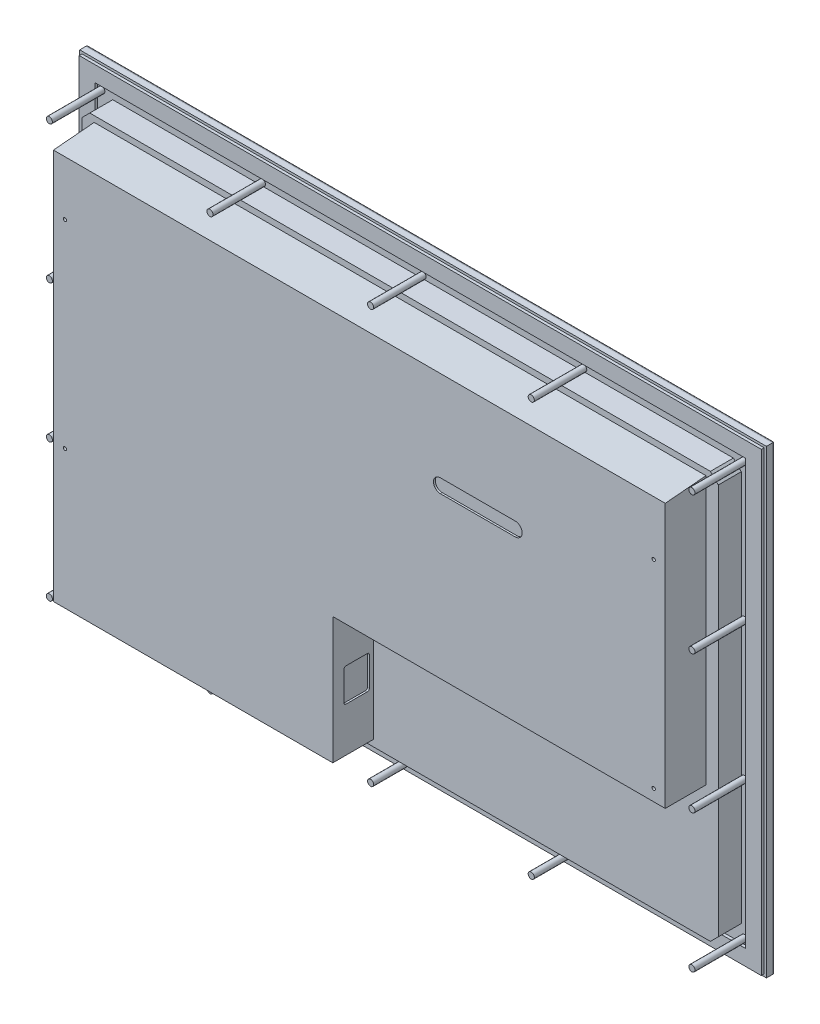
from build123d import *

# Parameters (mm, degrees)
SKETCH1_W                                 = 558.8
SKETCH1_H                                 = 374.65
BEZEL_DEPTH                               = 7.112
BEZEL_RADIUS_R                            = 2
SKETCH2_W                                 = 474.472
SKETCH2_H                                 = 296.672
WINDOW_DEPTH                              = 2.35
SKETCH3_W                                 = 554.99
SKETCH3_H                                 = 370.84
SKETCH3_W_2                               = 529.59
SKETCH3_H_2                               = 345.44
GASKET_DEPTH                              = 2.3
SKETCH5_R                                 = 2.5
PANEL_FRAME_STUDS_DEPTH                   = 42.7
BODY_DEPTH                                = 18.7198
REAR_COVER_DEPTH                          = 33.147
REAR_COVER_SLOPE_ANGLE                    = 5
SKETCH10_R                                = 1.5875
VIDEO_TOUCH_INTERFACE_DEPTH               = 1.524
POWER_AC_ONLY_DEPTH                       = 1.524
CONTROLS_BUTTONS_DEPTH                    = 1.524
F_6_32_ACCESSORY_BRACKET_HOLES_AT_2_COUNT = 2
F_6_32_ACCESSORY_BRACKET_HOLES_AT_2_PITCH = 161.3408
F_6_32_ACCESSORY_BRACKET_HOLES_AT_3_COUNT = 2
F_6_32_ACCESSORY_BRACKET_HOLES_AT_3_PITCH = 505.483934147
F_6_32_ACCESSORY_BRACKET_HOLES_AT_4_COUNT = 2
F_6_32_ACCESSORY_BRACKET_HOLES_AT_4_PITCH = 479.044


with BuildPart() as part:
    # Sketch1 → Bezel (new body)
    with BuildSketch(Plane.XY):
        Rectangle(SKETCH1_W, SKETCH1_H)
    extrude(amount=-BEZEL_DEPTH)

    # Bezel Radius
    bezel_radius_edges = [part.edges().sort_by_distance(p)[0] for p in [
        (279.4, 0, -7.112),
        (0, 187.325, -7.112),
        (-279.4, 0, -7.112),
        (0, -187.325, -7.112),
    ]]
    fillet(bezel_radius_edges, radius=BEZEL_RADIUS_R)

    # Sketch2 → Window (cut)
    with BuildSketch(Plane(origin=(0, 0, -7.112), x_dir=(-1, 0, 0), z_dir=(0, 0, -1))):
        Rectangle(SKETCH2_W, SKETCH2_H)
    extrude(amount=-WINDOW_DEPTH, mode=Mode.SUBTRACT)

    # Sketch3 → Gasket (add)
    with BuildSketch(Plane.XY):
        Rectangle(SKETCH3_W, SKETCH3_H)
        Rectangle(SKETCH3_W_2, SKETCH3_H_2, mode=Mode.SUBTRACT)
    extrude(amount=GASKET_DEPTH)

    # Sketch5 → Panel Frame Studs (add)
    with BuildSketch(Plane.XY):
        with Locations(Location((-261.4168, 168.1226, 0), (0, 0, 180))):
            Circle(SKETCH5_R)
        with Locations(Location((-130.7084, 168.1226, 0), (0, 0, 180))):
            Circle(SKETCH5_R)
        with Locations(Location((-130.7084, -168.1226, 0), (0, 0, 180))):
            Circle(SKETCH5_R)
        with Locations(Location((0, 168.1226, 0), (0, 0, 180))):
            Circle(SKETCH5_R)
        with Locations(Location((0, -168.1226, 0), (0, 0, 180))):
            Circle(SKETCH5_R)
        with Locations(Location((130.7084, 168.1226, 0), (0, 0, 180))):
            Circle(SKETCH5_R)
        with Locations(Location((130.7084, -168.1226, 0), (0, 0, 180))):
            Circle(SKETCH5_R)
        with Locations(Location((261.4168, 168.1226, 0), (0, 0, 180))):
            Circle(SKETCH5_R)
        with Locations(Location((261.4168, -168.1226, 0), (0, 0, 180))):
            Circle(SKETCH5_R)
        with Locations(Location((-261.4168, -168.148, 0), (0, 0, 180))):
            Circle(SKETCH5_R)
        with Locations(Location((-261.4168, 56.0324, 0), (0, 0, 180))):
            Circle(SKETCH5_R)
        with Locations(Location((261.4168, 56.0324, 0), (0, 0, 180))):
            Circle(SKETCH5_R)
        with Locations(Location((-261.4168, -56.0578, 0), (0, 0, 180))):
            Circle(SKETCH5_R)
        with Locations(Location((261.4168, -56.0578, 0), (0, 0, 180))):
            Circle(SKETCH5_R)
    extrude(amount=PANEL_FRAME_STUDS_DEPTH)


with BuildPart() as body_2:
    # Sketch6 → Body (new body)
    with BuildSketch(Plane.XY):
        Polygon((-258.9168, 159.21069713), (-252.50489713, 165.6226), (252.50489713, 165.6226), (258.9168, 159.21069713), (258.9168, -159.21069713), (252.50489713, -165.6226), (-252.50489713, -165.6226), (-258.9168, -159.21069713), align=None)
    extrude(amount=BODY_DEPTH)


with BuildPart() as body_3:
    # Sketch7 → Rear Cover (new body)
    with BuildSketch(Plane.XY.offset(18.7198)):
        Polygon((-248.92, 160.782), (248.92, 160.782), (248.92, -57.15), (-21.59, -57.15), (-21.59, -160.274), (-248.92, -160.274), align=None)
    extrude(amount=REAR_COVER_DEPTH)

    # Rear Cover Slope
    rear_cover_slope_faces = [body_3.faces().sort_by_distance(p)[0] for p in [
        (0, 160.782, 35.2933),
    ]]
    draft(rear_cover_slope_faces, Plane.XY.offset(18.7198), REAR_COVER_SLOPE_ANGLE)

    # Sketch10 → Video _ Touch Interface (cut)
    with BuildSketch(Plane(origin=(0, -57.15, 0), x_dir=(1, 0, 0), z_dir=(0, 1, 0))):
        with Locations((127.347305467, -30.10591993)):
            Circle(SKETCH10_R)
        with Locations((94.835305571, -30.10591993)):
            Circle(SKETCH10_R)
        with Locations((161.998305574, -31.62991993)):
            Circle(SKETCH10_R)
        with Locations((136.998311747, -31.62991993)):
            Circle(SKETCH10_R)
        with Locations((177.095734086, -31.62991993)):
            Circle(SKETCH10_R)
        with Locations((202.095727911, -31.62991993)):
            Circle(SKETCH10_R)
        with BuildLine():
            Line((124.75330861, -32.64591993), (124.75330861, -27.56591993))
            ThreePointArc((124.75330861, -27.56591993), (123.86783367, -25.366215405), (121.705308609, -24.393460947))
            Line((121.705308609, -24.393460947), (100.477302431, -24.393460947))
            ThreePointArc((100.477302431, -24.393460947), (98.31477737, -25.366215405), (97.42930243, -27.56591993))
            Line((97.42930243, -27.56591993), (97.42930243, -32.64591993))
            ThreePointArc((97.42930243, -32.64591993), (98.31477737, -34.845624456), (100.477302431, -35.818378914))
            Line((100.477302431, -35.818378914), (121.705308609, -35.818378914))
            ThreePointArc((121.705308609, -35.818378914), (123.86783367, -34.845624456), (124.75330861, -32.64591993))
        make_face()
        with BuildLine():
            Line((159.658269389, -29.07721993), (159.658269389, -34.15721993))
            ThreePointArc((159.658269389, -34.15721993), (158.772794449, -36.356924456), (156.61026939, -37.329678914))
            Line((156.61026939, -37.329678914), (142.386269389, -37.329678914))
            ThreePointArc((142.386269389, -37.329678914), (140.223744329, -36.356924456), (139.338269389, -34.15721993))
            Line((139.338269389, -34.15721993), (139.338269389, -29.07721993))
            ThreePointArc((139.338269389, -29.07721993), (140.22374433, -26.877515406), (142.386269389, -25.904760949))
            Line((142.386269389, -25.904760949), (156.482697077, -25.902219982))
            ThreePointArc((156.482697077, -25.902219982), (158.728131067, -26.831953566), (159.658269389, -29.07721993))
        make_face()
        with BuildLine():
            Line((179.435691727, -29.102619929), (179.435691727, -34.18261993))
            ThreePointArc((179.435691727, -34.18261993), (180.321166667, -36.382324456), (182.483691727, -37.355078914))
            Line((182.483691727, -37.355078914), (196.580119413, -37.35761988))
            ThreePointArc((196.580119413, -37.35761988), (198.825553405, -36.427886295), (199.755691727, -34.18261993))
            Line((199.755691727, -34.18261993), (199.755691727, -29.10261993))
            ThreePointArc((199.755691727, -29.10261993), (198.870216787, -26.902915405), (196.707691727, -25.930160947))
            Line((196.707691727, -25.930160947), (182.483691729, -25.930160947))
            ThreePointArc((182.483691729, -25.930160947), (180.321166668, -26.902915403), (179.435691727, -29.102619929))
        make_face()
        with BuildLine():
            Line((233.203103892, -25.53391993), (217.201103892, -25.53391993))
            Line((217.201103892, -25.53391993), (217.201103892, -30.04241993))
            Line((217.201103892, -30.04241993), (212.756103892, -30.04241993))
            ThreePointArc((212.756103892, -30.04241993), (211.168603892, -31.62991993), (212.756103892, -33.21741993))
            Line((212.756103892, -33.21741993), (217.201103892, -33.21741993))
            Line((217.201103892, -33.21741993), (217.201103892, -37.72591993))
            Line((217.201103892, -37.72591993), (233.203103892, -37.72591993))
            Line((233.203103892, -37.72591993), (233.203103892, -33.21741993))
            Line((233.203103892, -33.21741993), (237.648103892, -33.21741993))
            ThreePointArc((237.648103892, -33.21741993), (239.235603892, -31.62991993), (237.648103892, -30.04241993))
            Line((237.648103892, -30.04241993), (233.203103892, -30.04241993))
            Line((233.203103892, -30.04241993), (233.203103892, -25.53391993))
        make_face()
    extrude(amount=VIDEO_TOUCH_INTERFACE_DEPTH, mode=Mode.SUBTRACT)

    # Sketch11 → Power AC Only (cut)
    with BuildSketch(Plane.ZY.offset(21.59)):
        with BuildLine():
            Line((22.187143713, -98.77325365), (22.187143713, -122.71275204))
            ThreePointArc((22.187143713, -122.71275204), (22.632959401, -123.789828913), (23.709577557, -124.236751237))
            Line((23.709577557, -124.236751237), (41.160952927, -124.236751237))
            ThreePointArc((41.160952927, -124.236751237), (42.238583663, -123.79038197), (42.684952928, -122.712751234))
            Line((42.684952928, -122.712751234), (42.684952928, -98.773252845))
            ThreePointArc((42.684952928, -98.773252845), (42.23913724, -97.696175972), (41.162519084, -97.24925365))
            Line((41.162519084, -97.24925365), (23.711143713, -97.24925365))
            ThreePointArc((23.711143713, -97.24925365), (22.633512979, -97.695622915), (22.187143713, -98.77325365))
        make_face()
    extrude(amount=POWER_AC_ONLY_DEPTH, mode=Mode.SUBTRACT)

    # Sketch12 → Controls Buttons (cut)
    with BuildSketch(Plane.XY.offset(51.8668)):
        with BuildLine():
            Line((65.913, 73.1774), (126.873, 73.1774))
            ThreePointArc((126.873, 73.1774), (132.461, 78.7654), (126.873, 84.3534))
            Line((126.873, 84.3534), (65.913, 84.3534))
            ThreePointArc((65.913, 84.3534), (60.325, 78.7654), (65.913, 73.1774))
        make_face()
    extrude(amount=-CONTROLS_BUTTONS_DEPTH, mode=Mode.SUBTRACT)

    # Sketch14 → 6-32 Accessory Bracket Holes (revolve, cut)
    with BuildSketch(Plane(origin=(-239.522, -47.752, 51.8668), x_dir=(0, -1, 0), z_dir=(1, 0, 0))):
        Polygon((0, 0), (0, 16.81469403), (1.35255, 16.002), (1.35255, 0), align=None)
    f_6_32_accessory_bracket_holes = revolve(axis=Axis((-239.522, -47.752, 58.2168), (0, 0, -1)), mode=Mode.SUBTRACT)

    # 6-32 Accessory Bracket Holes at 2: 6-32 Accessory Bracket Holes ×2
    with Locations(*[(0, i * F_6_32_ACCESSORY_BRACKET_HOLES_AT_2_PITCH, 0) for i in range(1, F_6_32_ACCESSORY_BRACKET_HOLES_AT_2_COUNT)]):
        add(f_6_32_accessory_bracket_holes, mode=Mode.SUBTRACT)

    # 6-32 Accessory Bracket Holes at 3: 6-32 Accessory Bracket Holes ×2
    with Locations(*[Vector(0.9476938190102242, 0.31918086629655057, 0) * (i * F_6_32_ACCESSORY_BRACKET_HOLES_AT_3_PITCH) for i in range(1, F_6_32_ACCESSORY_BRACKET_HOLES_AT_3_COUNT)]):
        add(f_6_32_accessory_bracket_holes, mode=Mode.SUBTRACT)

    # 6-32 Accessory Bracket Holes at 4: 6-32 Accessory Bracket Holes ×2
    with Locations(*[(i * F_6_32_ACCESSORY_BRACKET_HOLES_AT_4_PITCH, 0, 0) for i in range(1, F_6_32_ACCESSORY_BRACKET_HOLES_AT_4_COUNT)]):
        add(f_6_32_accessory_bracket_holes, mode=Mode.SUBTRACT)


solid = Compound([part.part, body_2.part, body_3.part])
